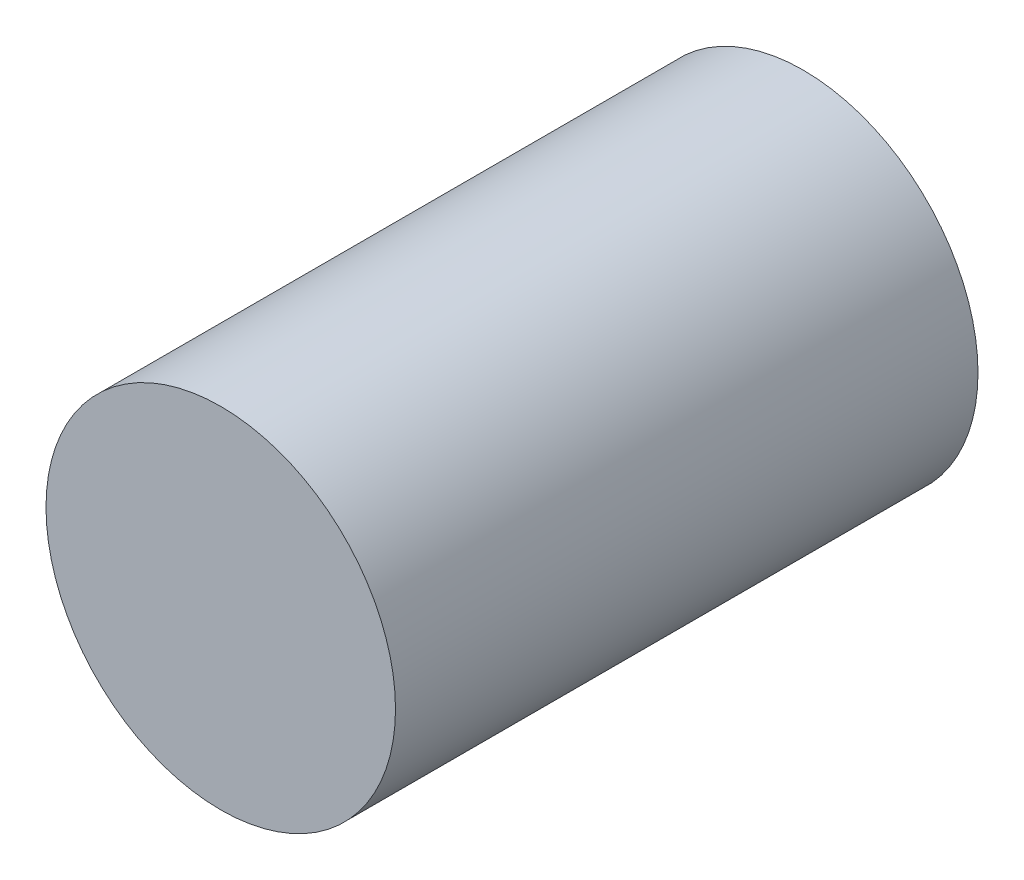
from build123d import *

# Parameters (mm, degrees)
ESQUISSE1_R        = 3
BOSS_EXTRU_1_DEPTH = 10


with BuildPart() as part:
    # Esquisse1 → Boss.-Extru.1 (new body)
    with BuildSketch(Plane.XY):
        Circle(ESQUISSE1_R)
    extrude(amount=BOSS_EXTRU_1_DEPTH)


solid = part.part
